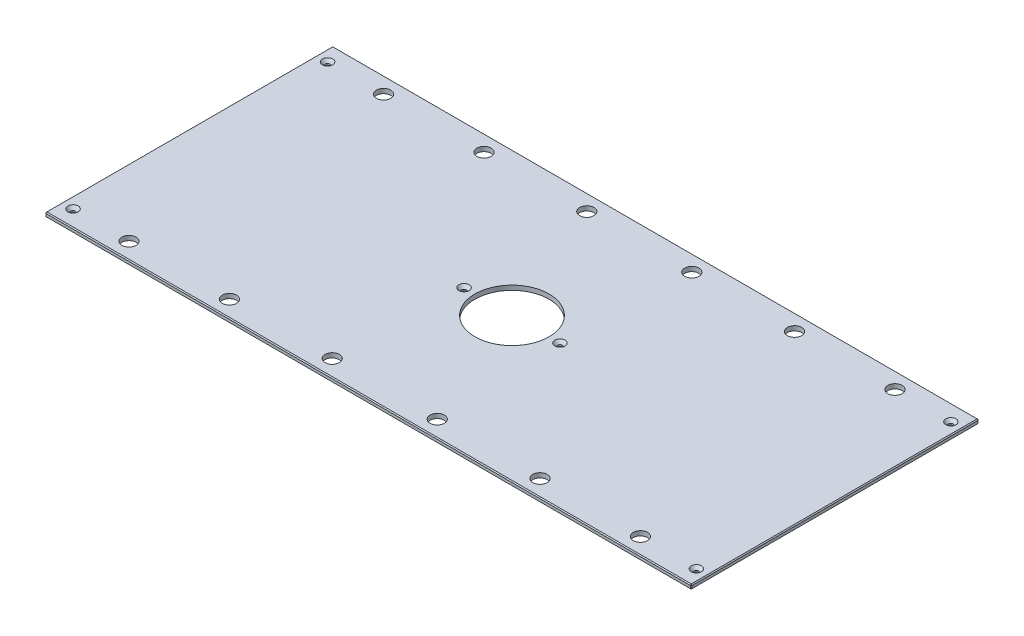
from build123d import *

# Parameters (mm, degrees)
SKETCH1_W                                     = 898.525
SKETCH1_H                                     = 400.05
BOSS_EXTRUDE1_DEPTH                           = 6.35
SKETCH13_R                                    = 51.562
CUT_EXTRUDE6_DEPTH                            = 492.820208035
F_25_32_0_78125_DIAMETER_HOLE1_D              = 19.84375
CHAMFER2_SIZE                                 = 1.27
CSK_FOR_1_4_FLAT_HEAD_MACHINE_SCREW1_AT_COUNT = 2
CSK_FOR_1_4_FLAT_HEAD_MACHINE_SCREW1_AT_PITCH = 354.00996
CSK_FOR_1_4_FLAT_HEAD_MACHINE_SCREW1_2_COUNT  = 2
CSK_FOR_1_4_FLAT_HEAD_MACHINE_SCREW1_2_PITCH  = 936.280915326
CSK_FOR_1_4_FLAT_HEAD_MACHINE_SCREW1_3_COUNT  = 2
CSK_FOR_1_4_FLAT_HEAD_MACHINE_SCREW1_3_PITCH  = 530.465141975
CSK_FOR_1_4_FLAT_HEAD_MACHINE_SCREW1_4_COUNT  = 2
CSK_FOR_1_4_FLAT_HEAD_MACHINE_SCREW1_4_PITCH  = 407.19629247
CSK_FOR_1_4_FLAT_HEAD_MACHINE_SCREW1_5_COUNT  = 2
CSK_FOR_1_4_FLAT_HEAD_MACHINE_SCREW1_5_PITCH  = 866.775
CSK_FOR_1_4_FLAT_HEAD_MACHINE_SCREW1_6_COUNT  = 2
CSK_FOR_1_4_FLAT_HEAD_MACHINE_SCREW1_6_PITCH  = 788.9875
CSK_FOR_1_4_FLAT_HEAD_MACHINE_SCREW1_7_COUNT  = 2
CSK_FOR_1_4_FLAT_HEAD_MACHINE_SCREW1_7_PITCH  = 864.768366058


with BuildPart() as part:
    # Sketch1 → Boss-Extrude1 (new body)
    with BuildSketch(Plane(origin=(0, 0, 0), x_dir=(1, 0, 0), z_dir=(0, 1, 0))):
        Rectangle(SKETCH1_W, SKETCH1_H)
    extrude(amount=BOSS_EXTRUDE1_DEPTH)

    # Sketch13 → Cut-Extrude6 (cut, through all)
    with BuildSketch(Plane(origin=(0, 6.35, 0), x_dir=(1, 0, 0), z_dir=(0, 1, 0))):
        with Locations(Location((0, 0, 0), (0, 0, 270))):
            Circle(SKETCH13_R)
    extrude(amount=-CUT_EXTRUDE6_DEPTH, mode=Mode.SUBTRACT)

    # 25_32 _0.78125_ Diameter Hole1 (through all)
    with Locations(Plane(origin=(0, 6.35, 0), x_dir=(1, 0, 0), z_dir=(0, 1, 0))):
        with Locations((355.6, 177.00498), (-355.6, 177.00498), (355.6, -177.00498), (-355.6, -177.00498), (-215.9, 177.00498), (215.9, 177.00498), (215.9, -177.00498), (-215.9, -177.00498), (73.025, 177.00498), (-73.025, 177.00498), (-73.025, -177.00498), (73.025, -177.00498)):
            Hole(F_25_32_0_78125_DIAMETER_HOLE1_D / 2)

    # Chamfer2
    chamfer2_edges = [part.edges().sort_by_distance(p)[0] for p in [
        (449.2625, 6.35, 0),
        (0, 6.35, -200.025),
        (-449.2625, 6.35, 0),
        (0, 0, -200.025),
        (449.2625, 0, 0),
        (0, 0, 200.025),
        (-449.2625, 0, 0),
        (0, 6.35, 200.025),
        (-449.2625, 3.175, -200.025),
        (449.2625, 3.175, -200.025),
        (449.2625, 3.175, 200.025),
        (-449.2625, 3.175, 200.025),
    ]]
    chamfer(chamfer2_edges, length=CHAMFER2_SIZE)

    # Sketch24 → CSK for 1_4 Flat Head Machine Screw1 (revolve, cut)
    with BuildSketch(Plane(origin=(433.3875, 6.35, -177.00498), x_dir=(0, 0, 1), z_dir=(1, 0, 0))):
        Polygon((0, 0), (0, 6.35), (3.3782, 6.35), (3.3782, 4.324464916), (7.1374, 0), align=None)
    csk_for_1_4_flat_head_machine_screw1 = revolve(axis=Axis((433.3875, 12.7, -177.00498), (0, -1, 0)), mode=Mode.SUBTRACT)

    # CSK for 1_4 Flat Head Machine Screw1 at: CSK for 1_4 Flat Head Machine Screw1 ×2
    with Locations(*[(0, 0, i * CSK_FOR_1_4_FLAT_HEAD_MACHINE_SCREW1_AT_PITCH) for i in range(1, CSK_FOR_1_4_FLAT_HEAD_MACHINE_SCREW1_AT_COUNT)]):
        add(csk_for_1_4_flat_head_machine_screw1, mode=Mode.SUBTRACT)

    # CSK for 1_4 Flat Head Machine Screw1 2: CSK for 1_4 Flat Head Machine Screw1 ×2
    with Locations(*[Vector(-0.9257638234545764, 0, 0.37810229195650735) * (i * CSK_FOR_1_4_FLAT_HEAD_MACHINE_SCREW1_2_PITCH) for i in range(1, CSK_FOR_1_4_FLAT_HEAD_MACHINE_SCREW1_2_COUNT)]):
        add(csk_for_1_4_flat_head_machine_screw1, mode=Mode.SUBTRACT)

    # CSK for 1_4 Flat Head Machine Screw1 3: CSK for 1_4 Flat Head Machine Screw1 ×2
    with Locations(*[Vector(-0.9426868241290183, 0, 0.33367881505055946) * (i * CSK_FOR_1_4_FLAT_HEAD_MACHINE_SCREW1_3_PITCH) for i in range(1, CSK_FOR_1_4_FLAT_HEAD_MACHINE_SCREW1_3_COUNT)]):
        add(csk_for_1_4_flat_head_machine_screw1, mode=Mode.SUBTRACT)

    # CSK for 1_4 Flat Head Machine Screw1 4: CSK for 1_4 Flat Head Machine Screw1 ×2
    with Locations(*[Vector(-0.9005791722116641, 0, 0.43469202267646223) * (i * CSK_FOR_1_4_FLAT_HEAD_MACHINE_SCREW1_4_PITCH) for i in range(1, CSK_FOR_1_4_FLAT_HEAD_MACHINE_SCREW1_4_COUNT)]):
        add(csk_for_1_4_flat_head_machine_screw1, mode=Mode.SUBTRACT)

    # CSK for 1_4 Flat Head Machine Screw1 5: CSK for 1_4 Flat Head Machine Screw1 ×2
    with Locations(*[(-i * CSK_FOR_1_4_FLAT_HEAD_MACHINE_SCREW1_5_PITCH, 0, 0) for i in range(1, CSK_FOR_1_4_FLAT_HEAD_MACHINE_SCREW1_5_COUNT)]):
        add(csk_for_1_4_flat_head_machine_screw1, mode=Mode.SUBTRACT)

    # CSK for 1_4 Flat Head Machine Screw1 6: CSK for 1_4 Flat Head Machine Screw1 ×2
    with Locations(*[(-i * CSK_FOR_1_4_FLAT_HEAD_MACHINE_SCREW1_6_PITCH, 0, 0) for i in range(1, CSK_FOR_1_4_FLAT_HEAD_MACHINE_SCREW1_6_COUNT)]):
        add(csk_for_1_4_flat_head_machine_screw1, mode=Mode.SUBTRACT)

    # CSK for 1_4 Flat Head Machine Screw1 7: CSK for 1_4 Flat Head Machine Screw1 ×2
    with Locations(*[Vector(-0.912368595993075, 0, 0.4093696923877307) * (i * CSK_FOR_1_4_FLAT_HEAD_MACHINE_SCREW1_7_PITCH) for i in range(1, CSK_FOR_1_4_FLAT_HEAD_MACHINE_SCREW1_7_COUNT)]):
        add(csk_for_1_4_flat_head_machine_screw1, mode=Mode.SUBTRACT)


solid = part.part
